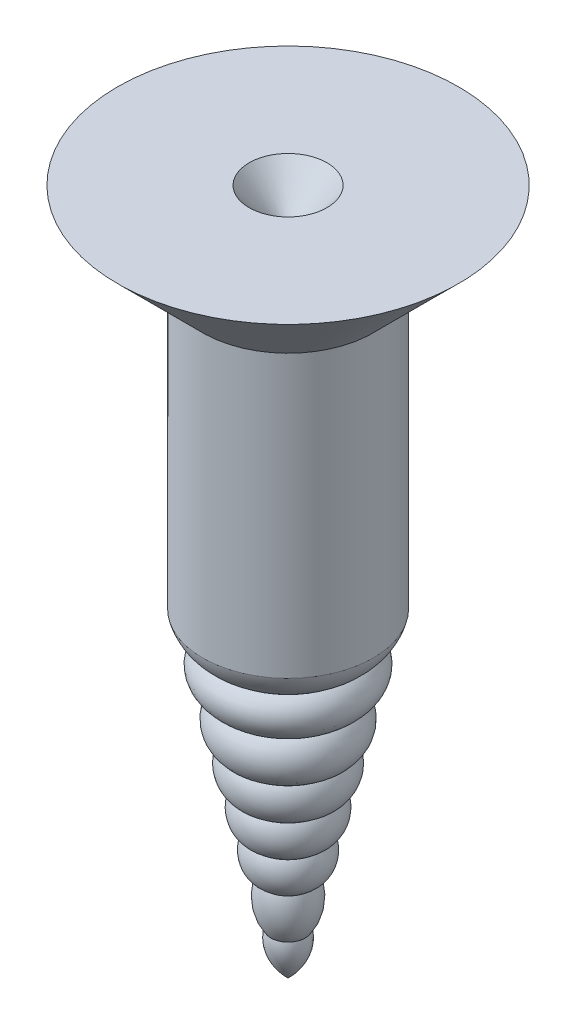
from build123d import *


with BuildPart() as part:
    # Sketch1 → Revolve3 (revolve)
    with BuildSketch(Plane.XY, mode=Mode.PRIVATE) as revolve3_sk:
        with BuildLine():
            Line((0.724771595, 0.875180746), (0, 0))
            Line((0, 0), (0, -11.908587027))
            add(Edge.make_bspline(
                [(0, -11.908587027), (0.415527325, -11.51769271), (0.318183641, -11.106308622)],
                knots=[5.667213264, 5.667213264, 5.667213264, 6.348958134, 6.348958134, 6.348958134], degree=2, weights=[1, 0.942463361, 1]))
            add(Edge.make_bspline(
                [(0.318183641, -11.106308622), (0.589601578, -10.733829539), (0.436054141, -10.27911478)],
                knots=[0.866813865, 0.866813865, 0.866813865, 1.945758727, 1.945758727, 1.945758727], degree=2, weights=[1, 0.857979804, 1]))
            add(Edge.make_bspline(
                [(0.436054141, -10.27911478), (0.843979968, -10.012349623), (0.597442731, -9.580296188)],
                knots=[3.700625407, 3.700625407, 3.700625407, 5.250612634, 5.250612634, 5.250612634], degree=2, weights=[1, 0.714425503, 1]))
            add(Edge.make_bspline(
                [(0.597442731, -9.580296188), (1.023408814, -9.322204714), (0.752822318, -8.878074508)],
                knots=[0.504726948, 0.504726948, 0.504726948, 2.161788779, 2.161788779, 2.161788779], degree=2, weights=[1, 0.675959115, 1]))
            add(Edge.make_bspline(
                [(0.752822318, -8.878074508), (1.205760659, -8.610449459), (0.911170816, -8.166765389)],
                knots=[0.63876212, 0.63876212, 0.63876212, 2.333282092, 2.333282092, 2.333282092], degree=2, weights=[1, 0.662039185, 1]))
            add(Edge.make_bspline(
                [(0.911170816, -8.166765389), (1.517389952, -7.80370481), (0.985915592, -7.337281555)],
                knots=[3.690848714, 3.690848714, 3.690848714, 5.576962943, 5.576962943, 5.576962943], degree=2, weights=[1, 0.587316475, 1]))
            add(Edge.make_bspline(
                [(0.985915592, -7.337281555), (1.764010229, -6.973185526), (1.192349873, -6.496178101)],
                knots=[5.213982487, 5.213982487, 5.213982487, 6.908276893, 6.908276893, 6.908276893], degree=2, weights=[1, 0.662123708, 1]))
            add(Edge.make_bspline(
                [(1.192349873, -6.496178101), (1.511850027, -6.279030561), (1.5875, -5.954392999)],
                knots=[5.437403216, 5.437403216, 5.437403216, 6.108565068, 6.108565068, 6.108565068], degree=2, weights=[1, 0.94421916, 1]))
            Line((1.5875, -5.954392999), (1.5875, -0.712319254))
            Line((1.5875, -0.712319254), (3.175, 0.875180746))
            Line((3.175, 0.875180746), (0.724771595, 0.875180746))
        make_face()
    revolve(revolve3_sk.sketch.rotate(Axis((0, 0, 0), (0, -1, 0)), 180), axis=Axis((0, 0, 0), (0, -1, 0)))


solid = part.part
